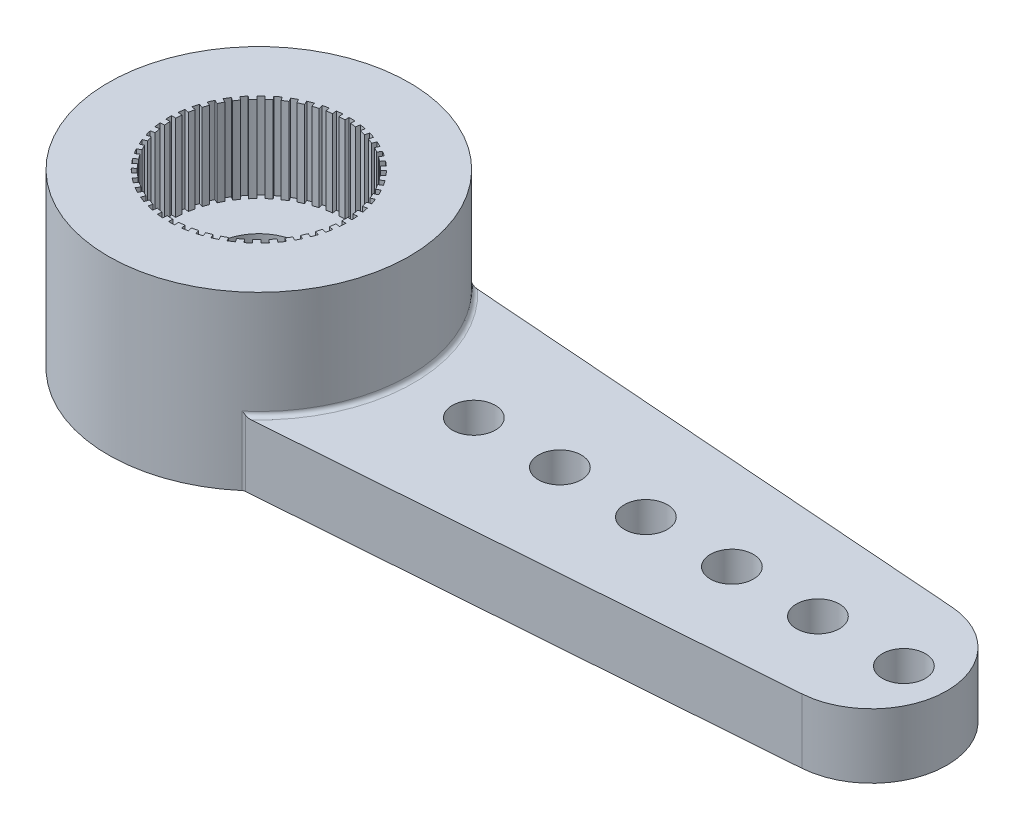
from build123d import *

# Parameters (mm, degrees)
SKETCH1_R           = 3.5
BOSS_EXTRUDE1_DEPTH = 4
BOSS_EXTRUDE2_DEPTH = 1.5
SKETCH3_R           = 2.5
SKETCH3_R_2         = 1
BOSS_EXTRUDE3_DEPTH = 2
SKETCH4_R           = 2.5
CUT_EXTRUDE1_DEPTH  = 1
SKETCH5_R           = 0.5
CUT_EXTRUDE2_DEPTH  = 11
FILLET1_R           = 0.1


with BuildPart() as part:
    # Sketch1 → Boss-Extrude1 (new body)
    with BuildSketch(Plane(origin=(0, 0, 0), x_dir=(1, 0, 0), z_dir=(0, 1, 0))):
        with Locations(Location((0, 0, 0), (0, 0, 270))):
            Circle(SKETCH1_R)
        with BuildLine():
            Line((0.417939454, 2.055893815), (0.398427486, 1.959912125))
            ThreePointArc((0.398427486, 1.959912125), (0.464396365, 1.945336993), (0.529835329, 1.928542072))
            Line((0.529835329, 1.928542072), (0.555782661, 2.022987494))
            ThreePointArc((0.555782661, 2.022987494), (0.622348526, 2.003510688), (0.688234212, 1.981844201))
            Line((0.688234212, 1.981844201), (0.656103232, 1.889319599))
            ThreePointArc((0.656103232, 1.889319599), (0.719540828, 1.866081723), (0.782157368, 1.840714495))
            Line((0.782157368, 1.840714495), (0.820461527, 1.930858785))
            ThreePointArc((0.820461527, 1.930858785), (0.883837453, 1.9026834), (0.946247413, 1.87242853))
            Line((0.946247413, 1.87242853), (0.9020708, 1.785012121))
            ThreePointArc((0.9020708, 1.785012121), (0.961845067, 1.753526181), (1.020521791, 1.720039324))
            Line((1.020521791, 1.720039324), (1.070499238, 1.804273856))
            ThreePointArc((1.070499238, 1.804273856), (1.129554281, 1.767902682), (1.187374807, 1.729599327))
            Line((1.187374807, 1.729599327), (1.131940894, 1.648851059))
            ThreePointArc((1.131940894, 1.648851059), (1.186985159, 1.609678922), (1.240674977, 1.56867001))
            Line((1.240674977, 1.56867001), (1.301433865, 1.645491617))
            ThreePointArc((1.301433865, 1.645491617), (1.355114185, 1.601573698), (1.40731347, 1.555905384))
            Line((1.40731347, 1.555905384), (1.341611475, 1.48326621))
            ThreePointArc((1.341611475, 1.48326621), (1.390943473, 1.437106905), (1.43868829, 1.389307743))
            Line((1.43868829, 1.389307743), (1.509144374, 1.457345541))
            ThreePointArc((1.509144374, 1.457345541), (1.556492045, 1.406664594), (1.60213859, 1.354446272))
            Line((1.60213859, 1.354446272), (1.527340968, 1.291212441))
            ThreePointArc((1.527340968, 1.291212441), (1.570080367, 1.238889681), (1.611028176, 1.185153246))
            Line((1.611028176, 1.185153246), (1.689924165, 1.243193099))
            ThreePointArc((1.689924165, 1.243193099), (1.730094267, 1.186653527), (1.76837351, 1.128817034))
            Line((1.76837351, 1.128817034), (1.685815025, 1.076116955))
            ThreePointArc((1.685815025, 1.076116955), (1.72119914, 1.018564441), (1.754619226, 0.959849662))
            Line((1.754619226, 0.959849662), (1.84054722, 1.006855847))
            ThreePointArc((1.84054722, 1.006855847), (1.872822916, 0.945466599), (1.903051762, 0.88304403))
            Line((1.903051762, 0.88304403), (1.814205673, 0.841818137))
            ThreePointArc((1.814205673, 0.841818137), (1.841603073, 0.780062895), (1.866899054, 0.717417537))
            Line((1.866899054, 0.717417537), (1.958325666, 0.752551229))
            ThreePointArc((1.958325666, 0.752551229), (1.982130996, 0.687407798), (2.00377001, 0.621513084))
            Line((2.00377001, 0.621513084), (1.910221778, 0.592497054))
            ThreePointArc((1.910221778, 0.592497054), (1.929143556, 0.527641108), (1.945864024, 0.46218308))
            Line((1.945864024, 0.46218308), (2.041157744, 0.484817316))
            ThreePointArc((2.041157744, 0.484817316), (2.056067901, 0.417082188), (2.068730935, 0.348891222))
            Line((2.068730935, 0.348891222), (1.97214993, 0.332602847))
            ThreePointArc((1.97214993, 0.332602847), (1.982258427, 0.265803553), (1.990105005, 0.198700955))
            Line((1.990105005, 0.198700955), (2.087565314, 0.208431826))
            ThreePointArc((2.087565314, 0.208431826), (2.093314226, 0.139313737), (2.096775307, 0.070043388))
            Line((2.096775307, 0.070043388), (1.99888502, 0.066773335))
            ThreePointArc((1.99888502, 0.066773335), (1.999999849, -0.000777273), (1.998832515, -0.068326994))
            Line((1.998832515, -0.068326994), (2.096720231, -0.071673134))
            ThreePointArc((2.096720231, -0.071673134), (2.093205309, -0.140940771), (2.087402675, -0.210054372))
            Line((2.087402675, -0.210054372), (1.989949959, -0.20024775))
            ThreePointArc((1.989949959, -0.20024775), (1.982051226, -0.267344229), (1.971890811, -0.334135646))
            Line((1.971890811, -0.334135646), (2.068459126, -0.350499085))
            ThreePointArc((2.068459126, -0.350499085), (2.055743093, -0.418680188), (2.040780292, -0.486403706))
            Line((2.040780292, -0.486403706), (1.945504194, -0.463695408))
            ThreePointArc((1.945504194, -0.463695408), (1.928732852, -0.52914042), (1.909760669, -0.593981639))
            Line((1.909760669, -0.593981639), (2.003286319, -0.623070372))
            ThreePointArc((2.003286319, -0.623070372), (1.981596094, -0.688948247), (1.957740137, -0.754073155))
            Line((1.957740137, -0.754073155), (1.86634086, -0.718868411))
            ThreePointArc((1.86634086, -0.718868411), (1.840996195, -0.781494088), (1.813550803, -0.843228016))
            Line((1.813550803, -0.843228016), (1.90236482, -0.884522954))
            ThreePointArc((1.90236482, -0.884522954), (1.872087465, -0.946922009), (1.839764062, -1.008286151))
            Line((1.839764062, -1.008286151), (1.75387263, -0.96121319))
            ThreePointArc((1.75387263, -0.96121319), (1.720406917, -1.019901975), (1.684978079, -1.077426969))
            Line((1.684978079, -1.077426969), (1.767495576, -1.130191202))
            ThreePointArc((1.767495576, -1.130191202), (1.729171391, -1.187997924), (1.688957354, -1.244506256))
            Line((1.688957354, -1.244506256), (1.610106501, -1.186405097))
            ThreePointArc((1.610106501, -1.186405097), (1.569116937, -1.240109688), (1.526336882, -1.292399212))
            Line((1.526336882, -1.292399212), (1.601085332, -1.355691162))
            ThreePointArc((1.601085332, -1.355691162), (1.555398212, -1.407873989), (1.508011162, -1.458518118))
            Line((1.508011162, -1.458518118), (1.437607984, -1.390425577))
            ThreePointArc((1.437607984, -1.390425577), (1.389826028, -1.438187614), (1.340458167, -1.48430856))
            Line((1.340458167, -1.48430856), (1.406103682, -1.556998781))
            ThreePointArc((1.406103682, -1.556998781), (1.353868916, -1.602626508), (1.300154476, -1.646502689))
            Line((1.300154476, -1.646502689), (1.239455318, -1.569633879))
            ThreePointArc((1.239455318, -1.569633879), (1.185733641, -1.610601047), (1.130658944, -1.649730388))
            Line((1.130658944, -1.649730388), (1.186030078, -1.730521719))
            ThreePointArc((1.186030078, -1.730521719), (1.128179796, -1.76878012), (1.069096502, -1.805105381))
            Line((1.069096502, -1.805105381), (1.019184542, -1.720832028))
            ThreePointArc((1.019184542, -1.720832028), (0.960481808, -1.754273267), (0.900683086, -1.785712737))
            Line((0.900683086, -1.785712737), (0.944791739, -1.873163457))
            ThreePointArc((0.944791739, -1.873163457), (0.882358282, -1.903369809), (0.818960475, -1.931495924))
            Line((0.818960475, -1.931495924), (0.780726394, -1.841321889))
            ThreePointArc((0.780726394, -1.841321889), (0.718090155, -1.866640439), (0.654634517, -1.889829))
            Line((0.654634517, -1.889829), (0.68669357, -1.982378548))
            ThreePointArc((0.68669357, -1.982378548), (0.620791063, -2.003993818), (0.554210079, -2.023418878))
            Line((0.554210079, -2.023418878), (0.528336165, -1.928953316))
            ThreePointArc((0.528336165, -1.928953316), (0.462884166, -1.945697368), (0.396903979, -1.96022122))
            Line((0.396903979, -1.96022122), (0.416341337, -2.056218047))
            ThreePointArc((0.416341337, -2.056218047), (0.348145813, -2.06885651), (0.279569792, -2.079233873))
            Line((0.279569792, -2.079233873), (0.266517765, -1.982162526))
            ThreePointArc((0.266517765, -1.982162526), (0.199417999, -1.990033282), (0.13209068, -1.995633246))
            Line((0.13209068, -1.995633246), (0.138559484, -2.093364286))
            ThreePointArc((0.138559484, -2.093364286), (0.069287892, -2.096800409), (-5.9425e-05, -2.09794489))
            Line((-5.9425e-05, -2.09794489), (-5.6651e-05, -1.999999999))
            ThreePointArc((-5.6651e-05, -1.999999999), (-0.067606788, -1.998857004), (-0.13507978, -1.995433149))
            Line((-0.13507978, -1.995433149), (-0.141694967, -2.09315439))
            ThreePointArc((-0.141694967, -2.09315439), (-0.210806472, -2.087326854), (-0.279687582, -2.079218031))
            Line((-0.279687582, -2.079218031), (-0.266630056, -1.982147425))
            ThreePointArc((-0.266630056, -1.982147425), (-0.33342513, -1.972011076), (-0.399839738, -1.959624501))
            Line((-0.399839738, -1.959624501), (-0.419420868, -2.055592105))
            ThreePointArc((-0.419420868, -2.055592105), (-0.48713899, -2.040604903), (-0.554324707, -2.023387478))
            Line((-0.554324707, -2.023387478), (-0.528445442, -1.928923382))
            ThreePointArc((-0.528445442, -1.928923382), (-0.593293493, -1.909974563), (-0.657464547, -1.888846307))
            Line((-0.657464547, -1.888846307), (-0.689662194, -1.981347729))
            ThreePointArc((-0.689662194, -1.981347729), (-0.754778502, -1.957468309), (-0.819069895, -1.931449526))
            Line((-0.819069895, -1.931449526), (-0.780830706, -1.841277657))
            ThreePointArc((-0.780830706, -1.841277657), (-0.842574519, -1.813854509), (-0.903356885, -1.784361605))
            Line((-0.903356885, -1.784361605), (-0.947596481, -1.871746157))
            ThreePointArc((-0.947596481, -1.871746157), (-1.008948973, -1.839400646), (-1.069198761, -1.805044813))
            Line((-1.069198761, -1.805044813), (-1.019282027, -1.720774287))
            ThreePointArc((-1.019282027, -1.720774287), (-1.076819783, -1.685366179), (-1.133128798, -1.648034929))
            Line((-1.133128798, -1.648034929), (-1.188620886, -1.72874323))
            ThreePointArc((-1.188620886, -1.72874323), (-1.245114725, -1.688508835), (-1.30024775, -1.646429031))
            Line((-1.30024775, -1.646429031), (-1.239544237, -1.56956366))
            ThreePointArc((-1.239544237, -1.56956366), (-1.291849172, -1.526802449), (-1.342680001, -1.48229903))
            Line((-1.342680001, -1.48229903), (-1.408434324, -1.554890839))
            ThreePointArc((-1.408434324, -1.554890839), (-1.459061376, -1.507485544), (-1.508093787, -1.458432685))
            Line((-1.508093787, -1.458432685), (-1.437686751, -1.390344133))
            ThreePointArc((-1.437686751, -1.390344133), (-1.483825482, -1.340992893), (-1.528271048, -1.29011147))
            Line((-1.528271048, -1.29011147), (-1.603114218, -1.353291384))
            ThreePointArc((-1.603114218, -1.353291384), (-1.646971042, -1.299561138), (-1.689027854, -1.244410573))
            Line((-1.689027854, -1.244410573), (-1.61017371, -1.186313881))
            ThreePointArc((-1.61017371, -1.186313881), (-1.649322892, -1.131253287), (-1.686590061, -1.07490184))
            Line((-1.686590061, -1.07490184), (-1.769186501, -1.127542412))
            ThreePointArc((-1.769186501, -1.127542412), (-1.805490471, -1.068446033), (-1.83982118, -1.008181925))
            Line((-1.83982118, -1.008181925), (-1.753927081, -0.96111383))
            ThreePointArc((-1.753927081, -0.96111383), (-1.785388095, -0.901326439), (-1.814811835, -0.840510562))
            Line((-1.814811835, -0.840510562), (-1.903687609, -0.881672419))
            ThreePointArc((-1.903687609, -0.881672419), (-1.93179088, -0.818264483), (-1.957782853, -0.753962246))
            Line((-1.957782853, -0.753962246), (-1.866381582, -0.71876268))
            ThreePointArc((-1.866381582, -0.71876268), (-1.889593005, -0.6553154), (-1.910648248, -0.591120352))
            Line((-1.910648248, -0.591120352), (-2.004217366, -0.620068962))
            ThreePointArc((-2.004217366, -0.620068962), (-2.023618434, -0.553480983), (-2.040807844, -0.486288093))
            Line((-2.040807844, -0.486288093), (-1.94553046, -0.463585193))
            ThreePointArc((-1.94553046, -0.463585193), (-1.960078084, -0.397610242), (-1.972389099, -0.331181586))
            Line((-1.972389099, -0.331181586), (-2.068981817, -0.347400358))
            ThreePointArc((-2.068981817, -0.347400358), (-2.07933447, -0.278820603), (-2.087414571, -0.209936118))
            Line((-2.087414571, -0.209936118), (-1.9899613, -0.200135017))
            ThreePointArc((-1.9899613, -0.200135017), (-1.995585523, -0.13280972), (-1.998932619, -0.065332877))
            Line((-1.998932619, -0.065332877), (-2.096825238, -0.068532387))
            ThreePointArc((-2.096825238, -0.068532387), (-2.097944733, 0.000815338), (-2.096771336, 0.070162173))
            Line((-2.096771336, 0.070162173), (-1.998881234, 0.066886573))
            ThreePointArc((-1.998881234, 0.066886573), (-1.99548169, 0.134360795), (-1.989805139, 0.201681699))
            Line((-1.989805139, 0.201681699), (-2.087250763, 0.211558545))
            ThreePointArc((-2.087250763, 0.211558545), (-2.079117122, 0.280436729), (-2.068711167, 0.349008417))
            Line((-2.068711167, 0.349008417), (-1.972131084, 0.332714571))
            ThreePointArc((-1.972131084, 0.332714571), (-1.95976844, 0.399133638), (-1.94516954, 0.465097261))
            Line((-1.94516954, 0.465097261), (-2.040429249, 0.487874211))
            ThreePointArc((-2.040429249, 0.487874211), (-2.023187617, 0.55505372), (-2.003734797, 0.621626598))
            Line((-2.003734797, 0.621626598), (-1.910188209, 0.592605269))
            ThreePointArc((-1.910188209, 0.592605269), (-1.889083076, 0.656783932), (-1.865822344, 0.720213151))
            Line((-1.865822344, 0.720213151), (-1.957196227, 0.75548375))
            ThreePointArc((-1.957196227, 0.75548375), (-1.931154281, 0.819765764), (-1.903001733, 0.883151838))
            Line((-1.903001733, 0.883151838), (-1.81415798, 0.841920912))
            ThreePointArc((-1.81415798, 0.841920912), (-1.784686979, 0.902713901), (-1.753179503, 0.96247682))
            Line((-1.753179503, 0.96247682), (-1.839036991, 1.009611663))
            ThreePointArc((-1.839036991, 1.009611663), (-1.804659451, 1.069849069), (-1.768309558, 1.128917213))
            Line((-1.768309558, 1.128917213), (-1.685754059, 1.076212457))
            ThreePointArc((-1.685754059, 1.076212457), (-1.648443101, 1.132534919), (-1.609251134, 1.187565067))
            Line((-1.609251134, 1.187565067), (-1.688060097, 1.245723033))
            ThreePointArc((-1.688060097, 1.245723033), (-1.645960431, 1.300840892), (-1.602061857, 1.354537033))
            Line((-1.602061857, 1.354537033), (-1.527267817, 1.291298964))
            ThreePointArc((-1.527267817, 1.291298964), (-1.482782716, 1.342145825), (-1.436605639, 1.391461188))
            Line((-1.436605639, 1.391461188), (-1.506959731, 1.459604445))
            ThreePointArc((-1.506959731, 1.459604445), (-1.457889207, 1.508619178), (-1.407225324, 1.555985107))
            Line((-1.407225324, 1.555985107), (-1.341527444, 1.483342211))
            ThreePointArc((-1.341527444, 1.483342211), (-1.290662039, 1.527806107), (-1.238323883, 1.570526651))
            Line((-1.238323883, 1.570526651), (-1.298967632, 1.647439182))
            ThreePointArc((-1.298967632, 1.647439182), (-1.243801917, 1.689476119), (-1.187276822, 1.72966659))
            Line((-1.187276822, 1.72966659), (-1.131847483, 1.648915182))
            ThreePointArc((-1.131847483, 1.648915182), (-1.075509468, 1.686202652), (-1.017944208, 1.721566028))
            Line((-1.017944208, 1.721566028), (-1.067795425, 1.805875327))
            ThreePointArc((-1.067795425, 1.805875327), (-1.007518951, 1.840184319), (-0.946141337, 1.872482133))
            Line((-0.946141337, 1.872482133), (-0.901969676, 1.785063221))
            ThreePointArc((-0.901969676, 1.785063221), (-0.841164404, 1.814508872), (-0.779399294, 1.841884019))
            Line((-0.779399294, 1.841884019), (-0.817568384, 1.932085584))
            ThreePointArc((-0.817568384, 1.932085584), (-0.753256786, 1.958054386), (-0.688121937, 1.981883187))
            Line((-0.688121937, 1.981883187), (-0.655996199, 1.889356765))
            ThreePointArc((-0.655996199, 1.889356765), (-0.591808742, 1.910435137), (-0.526945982, 1.929333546))
            Line((-0.526945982, 1.929333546), (-0.552751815, 2.023817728))
            ThreePointArc((-0.552751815, 2.023817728), (-0.485552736, 2.040982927), (-0.417822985, 2.055917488))
            Line((-0.417822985, 2.055917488), (-0.398316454, 1.959934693))
            ThreePointArc((-0.398316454, 1.959934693), (-0.331892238, 1.972269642), (-0.265089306, 1.98235407))
            Line((-0.265089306, 1.98235407), (-0.278071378, 2.079434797))
            ThreePointArc((-0.278071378, 2.079434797), (-0.209183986, 2.087490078), (-0.140067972, 2.093263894))
            Line((-0.140067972, 2.093263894), (-0.133528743, 1.99553754))
            ThreePointArc((-0.133528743, 1.99553754), (-0.06605311, 1.998908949), (0.001497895, 1.999999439))
            Line((0.001497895, 1.999999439), (0.001571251, 2.097944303))
            ThreePointArc((0.001571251, 2.097944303), (0.070917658, 2.09674592), (0.140186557, 2.093255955))
            Line((0.140186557, 2.093255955), (0.133641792, 1.995529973))
            ThreePointArc((0.133641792, 1.995529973), (0.200964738, 1.989877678), (0.268058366, 1.981954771))
            Line((0.268058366, 1.981954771), (0.28118584, 2.079015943))
            ThreePointArc((0.28118584, 2.079015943), (0.349753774, 2.068585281), (0.417939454, 2.055893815))
        make_face(mode=Mode.SUBTRACT)
    extrude(amount=BOSS_EXTRUDE1_DEPTH)

    # Sketch2 → Boss-Extrude2 (add)
    with BuildSketch(Plane.XZ):
        with BuildLine():
            Line((0.953703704, 2.742445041), (14.37962963, 1.745192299))
            ThreePointArc((14.37962963, 1.745192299), (16, 0), (14.37962963, -1.745192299))
            Line((14.37962963, -1.745192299), (0.953703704, -2.742445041))
            ThreePointArc((0.953703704, -2.742445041), (3.5, 0), (0.953703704, 2.742445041))
        make_face()
    extrude(amount=-BOSS_EXTRUDE2_DEPTH)

    # Sketch3 → Boss-Extrude3 (add)
    with BuildSketch(Plane.XZ):
        Circle(SKETCH3_R)
        with Locations(Location((0, 0, 0), (0, 0, 270))):
            Circle(SKETCH3_R_2, mode=Mode.SUBTRACT)
    extrude(amount=-BOSS_EXTRUDE3_DEPTH)

    # Sketch4 → Cut-Extrude1 (cut)
    with BuildSketch(Plane.XZ):
        with Locations(Location((0, 0, 0), (0, 0, 270))):
            Circle(SKETCH4_R)
    extrude(amount=-CUT_EXTRUDE1_DEPTH, mode=Mode.SUBTRACT)

    # Sketch5 → Cut-Extrude2 (cut)
    with BuildSketch(Plane(origin=(0, 1.5, 0), x_dir=(1, 0, 0), z_dir=(0, 1, 0))):
        with Locations(Location((15, 0, 0), (0, 0, 270))):
            Circle(SKETCH5_R)
        with Locations(Location((13, 0, 0), (0, 0, 270))):
            Circle(SKETCH5_R)
        with Locations(Location((11, 0, 0), (0, 0, 270))):
            Circle(SKETCH5_R)
        with Locations(Location((9, 0, 0), (0, 0, 270))):
            Circle(SKETCH5_R)
        with Locations(Location((7, 0, 0), (0, 0, 270))):
            Circle(SKETCH5_R)
        with Locations(Location((5, 0, 0), (0, 0, 270))):
            Circle(SKETCH5_R)
    extrude(amount=-CUT_EXTRUDE2_DEPTH, mode=Mode.SUBTRACT)

    # Fillet1
    fillet1_edges = [part.edges().sort_by_distance(p)[0] for p in [
        (3.5, 1.5, 0),
        (2.294642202, 0.75, -2.642842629),
        (2.294642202, 0.75, 2.642842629),
    ]]
    fillet(fillet1_edges, radius=FILLET1_R)


solid = part.part
